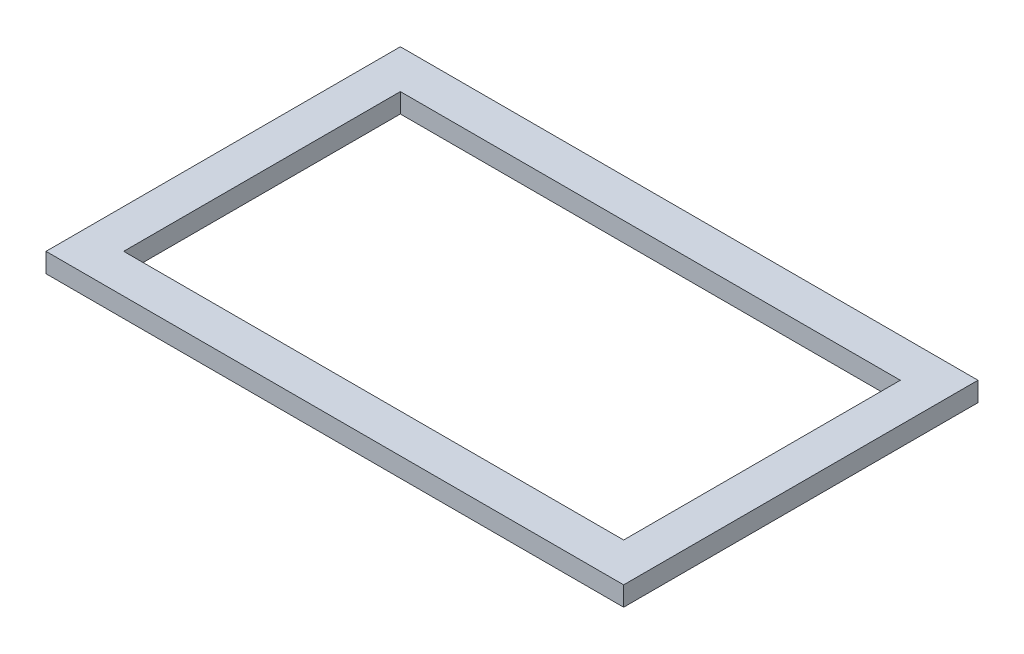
from build123d import *

# Parameters (mm, degrees)
SKETCH1_W      = 119
SKETCH1_H      = 73
SKETCH1_W_2    = 103
SKETCH1_H_2    = 57
EXTRUDE1_DEPTH = 4


with BuildPart() as part:
    # Sketch1 → Extrude1 (new body)
    with BuildSketch(Plane(origin=(0, 0, 0), x_dir=(1, 0, 0), z_dir=(0, 1, 0))):
        Rectangle(SKETCH1_W, SKETCH1_H)
        Rectangle(SKETCH1_W_2, SKETCH1_H_2, mode=Mode.SUBTRACT)
    extrude(amount=EXTRUDE1_DEPTH)


solid = part.part
